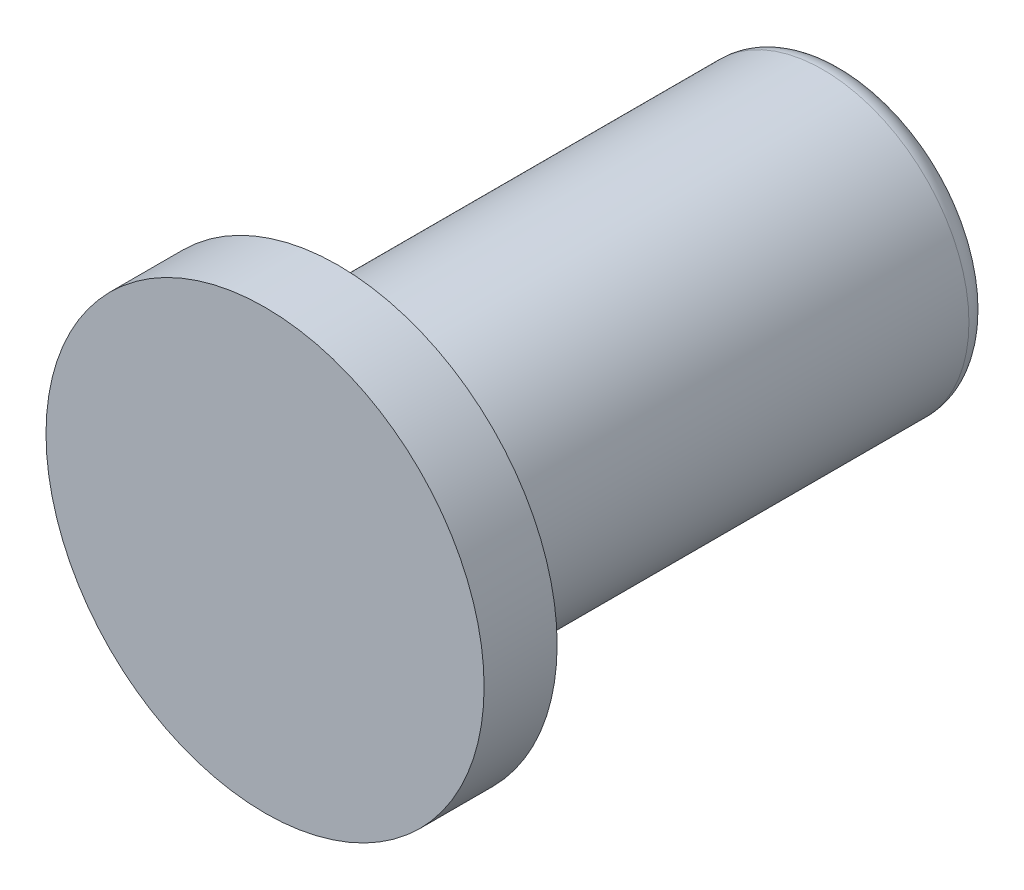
from build123d import *


with BuildPart() as part:
    # Sketch1 → Revolve1 (revolve)
    with BuildSketch(Plane(origin=(0, 0, 0), x_dir=(0, 0, -1), z_dir=(1, 0, 0)), mode=Mode.PRIVATE) as revolve1_sk:
        with BuildLine():
            Line((0, 0), (0, 15))
            Line((0, 15), (5, 15))
            Line((5, 15), (5, 10))
            Line((5, 10), (38.2, 10))
            ThreePointArc((38.2, 10), (39.260660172, 9.560660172), (39.7, 8.5))
            Line((39.7, 8.5), (39.7, 4.5))
            Line((39.7, 4.5), (39.2, 4))
            Line((39.2, 4), (30.7, 4))
            Line((30.7, 4), (28.390598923, 0))
            Line((28.390598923, 0), (0, 0))
        make_face()
    revolve(revolve1_sk.sketch.rotate(Axis((0, 0, 0), (0, 0, -1)), 90), axis=Axis((0, 0, 0), (0, 0, -1)))


solid = part.part
